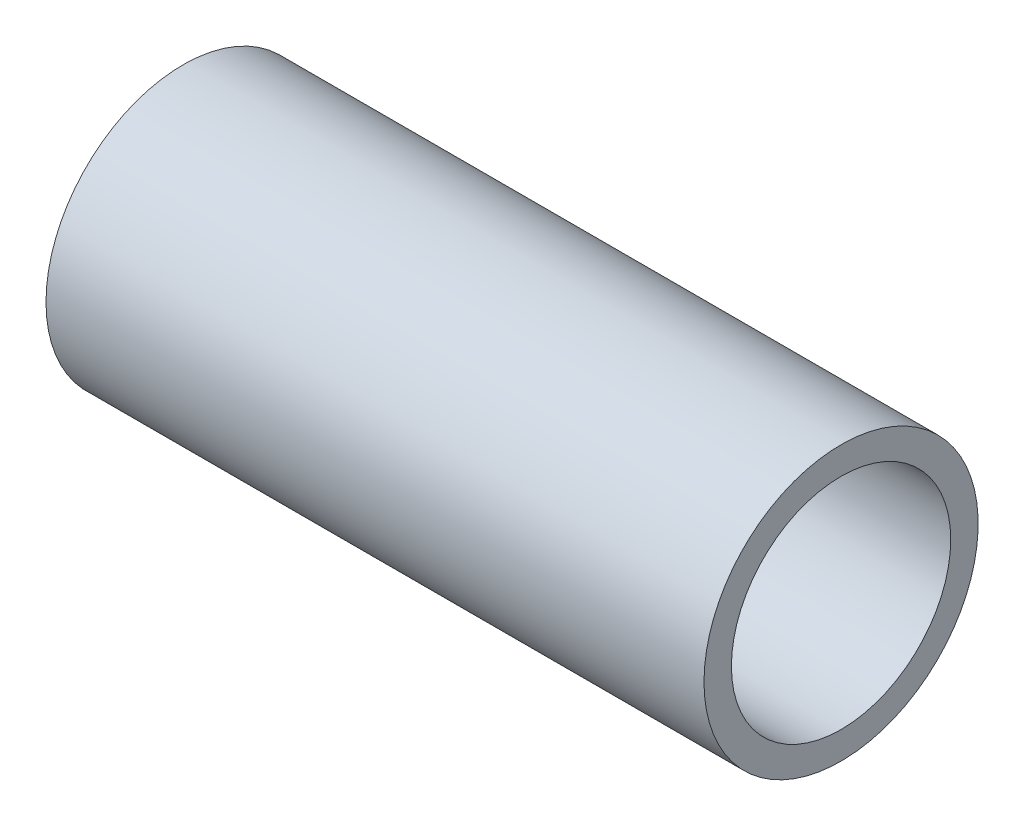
ISO-10303-21;
HEADER;
FILE_DESCRIPTION(('STEP AP214'),'2;1');
FILE_NAME('part.step','',(''),(''),'','','');
FILE_SCHEMA(('AUTOMOTIVE_DESIGN { 1 0 10303 214 1 1 1 1 }'));
ENDSEC;
DATA;
#1=APPLICATION_CONTEXT('core data for automotive mechanical design processes');
#2=APPLICATION_PROTOCOL_DEFINITION('international standard','automotive_design',2000,#1);
#3=PRODUCT_CONTEXT('',#1,'mechanical');
#4=PRODUCT('Part','Part','',(#3));
#5=PRODUCT_RELATED_PRODUCT_CATEGORY('part','',(#4));
#6=PRODUCT_DEFINITION_FORMATION('','',#4);
#7=PRODUCT_DEFINITION_CONTEXT('part definition',#1,'design');
#8=PRODUCT_DEFINITION('design','',#6,#7);
#9=PRODUCT_DEFINITION_SHAPE('','',#8);
#10=(LENGTH_UNIT() NAMED_UNIT(*) SI_UNIT(.MILLI.,.METRE.));
#11=(NAMED_UNIT(*) PLANE_ANGLE_UNIT() SI_UNIT($,.RADIAN.));
#12=(NAMED_UNIT(*) SI_UNIT($,.STERADIAN.) SOLID_ANGLE_UNIT());
#13=UNCERTAINTY_MEASURE_WITH_UNIT(LENGTH_MEASURE(1.E-05),#10,'distance_accuracy_value','');
#14=(GEOMETRIC_REPRESENTATION_CONTEXT(3) GLOBAL_UNCERTAINTY_ASSIGNED_CONTEXT((#13)) GLOBAL_UNIT_ASSIGNED_CONTEXT((#10,
#11,#12)) REPRESENTATION_CONTEXT('',''));
#15=CARTESIAN_POINT('',(0.,0.,0.));
#16=DIRECTION('',(0.,0.,1.));
#17=DIRECTION('',(1.,0.,0.));
#18=AXIS2_PLACEMENT_3D('',#15,#16,#17);
#19=CARTESIAN_POINT('',(76.2,0.,0.));
#20=DIRECTION('',(1.,0.,0.));
#21=DIRECTION('',(0.,0.,-1.));
#22=AXIS2_PLACEMENT_3D('',#19,#20,#21);
#23=PLANE('',#22);
#24=CARTESIAN_POINT('',(76.2,0.,0.));
#25=DIRECTION('',(1.,0.,0.));
#26=DIRECTION('',(0.,0.,-1.));
#27=AXIS2_PLACEMENT_3D('',#24,#25,#26);
#28=CIRCLE('',#27,15.875);
#29=CARTESIAN_POINT('',(76.2,0.,15.875));
#30=VERTEX_POINT('',#29);
#31=EDGE_CURVE('E10',#30,#30,#28,.T.);
#32=ORIENTED_EDGE('',*,*,#31,.T.);
#33=EDGE_LOOP('',(#32));
#34=FACE_BOUND('',#33,.T.);
#35=CARTESIAN_POINT('',(76.2,0.,0.));
#36=DIRECTION('',(1.,0.,0.));
#37=DIRECTION('',(0.,0.,-1.));
#38=AXIS2_PLACEMENT_3D('',#35,#36,#37);
#39=CIRCLE('',#38,12.7);
#40=CARTESIAN_POINT('',(76.2,0.,12.7));
#41=VERTEX_POINT('',#40);
#42=EDGE_CURVE('E37',#41,#41,#39,.T.);
#43=ORIENTED_EDGE('',*,*,#42,.F.);
#44=EDGE_LOOP('',(#43));
#45=FACE_BOUND('',#44,.T.);
#46=ADVANCED_FACE('F26',(#34,#45),#23,.T.);
#47=CARTESIAN_POINT('',(0.,0.,0.));
#48=DIRECTION('',(1.,0.,0.));
#49=DIRECTION('',(0.,0.,-1.));
#50=AXIS2_PLACEMENT_3D('',#47,#48,#49);
#51=PLANE('',#50);
#52=CARTESIAN_POINT('',(0.,0.,0.));
#53=DIRECTION('',(1.,0.,0.));
#54=DIRECTION('',(0.,0.,-1.));
#55=AXIS2_PLACEMENT_3D('',#52,#53,#54);
#56=CIRCLE('',#55,15.875);
#57=CARTESIAN_POINT('',(0.,0.,15.875));
#58=VERTEX_POINT('',#57);
#59=EDGE_CURVE('E33',#58,#58,#56,.T.);
#60=ORIENTED_EDGE('',*,*,#59,.F.);
#61=EDGE_LOOP('',(#60));
#62=FACE_BOUND('',#61,.T.);
#63=CARTESIAN_POINT('',(0.,0.,0.));
#64=DIRECTION('',(1.,0.,0.));
#65=DIRECTION('',(0.,0.,-1.));
#66=AXIS2_PLACEMENT_3D('',#63,#64,#65);
#67=CIRCLE('',#66,12.7);
#68=CARTESIAN_POINT('',(0.,0.,12.7));
#69=VERTEX_POINT('',#68);
#70=EDGE_CURVE('E41',#69,#69,#67,.T.);
#71=ORIENTED_EDGE('',*,*,#70,.T.);
#72=EDGE_LOOP('',(#71));
#73=FACE_BOUND('',#72,.T.);
#74=ADVANCED_FACE('F47',(#62,#73),#51,.F.);
#75=CARTESIAN_POINT('',(76.2,0.,0.));
#76=DIRECTION('',(-1.,0.,0.));
#77=DIRECTION('',(0.,0.,1.));
#78=AXIS2_PLACEMENT_3D('',#75,#76,#77);
#79=CYLINDRICAL_SURFACE('',#78,15.875);
#80=CARTESIAN_POINT('',(76.2,0.,15.875));
#81=CARTESIAN_POINT('',(75.40625,0.,15.875));
#82=CARTESIAN_POINT('',(74.6125,0.,15.875));
#83=CARTESIAN_POINT('',(73.025,0.,15.875));
#84=CARTESIAN_POINT('',(72.23125,0.,15.875));
#85=CARTESIAN_POINT('',(70.64375,0.,15.875));
#86=CARTESIAN_POINT('',(69.85,0.,15.875));
#87=CARTESIAN_POINT('',(68.2625,0.,15.875));
#88=CARTESIAN_POINT('',(67.46875,0.,15.875));
#89=CARTESIAN_POINT('',(65.88125,0.,15.875));
#90=CARTESIAN_POINT('',(65.0875,0.,15.875));
#91=CARTESIAN_POINT('',(63.5,0.,15.875));
#92=CARTESIAN_POINT('',(62.70625,0.,15.875));
#93=CARTESIAN_POINT('',(61.11875,0.,15.875));
#94=CARTESIAN_POINT('',(60.325,0.,15.875));
#95=CARTESIAN_POINT('',(58.7375,0.,15.875));
#96=CARTESIAN_POINT('',(57.94375,0.,15.875));
#97=CARTESIAN_POINT('',(56.35625,0.,15.875));
#98=CARTESIAN_POINT('',(55.5625,0.,15.875));
#99=CARTESIAN_POINT('',(53.975,0.,15.875));
#100=CARTESIAN_POINT('',(53.18125,0.,15.875));
#101=CARTESIAN_POINT('',(51.59375,0.,15.875));
#102=CARTESIAN_POINT('',(50.8,0.,15.875));
#103=CARTESIAN_POINT('',(49.2125,0.,15.875));
#104=CARTESIAN_POINT('',(48.41875,0.,15.875));
#105=CARTESIAN_POINT('',(46.83125,0.,15.875));
#106=CARTESIAN_POINT('',(46.0375,0.,15.875));
#107=CARTESIAN_POINT('',(44.45,0.,15.875));
#108=CARTESIAN_POINT('',(43.65625,0.,15.875));
#109=CARTESIAN_POINT('',(42.06875,0.,15.875));
#110=CARTESIAN_POINT('',(41.275,0.,15.875));
#111=CARTESIAN_POINT('',(39.6875,0.,15.875));
#112=CARTESIAN_POINT('',(38.89375,0.,15.875));
#113=CARTESIAN_POINT('',(37.30625,0.,15.875));
#114=CARTESIAN_POINT('',(36.5125,0.,15.875));
#115=CARTESIAN_POINT('',(34.925,0.,15.875));
#116=CARTESIAN_POINT('',(34.13125,0.,15.875));
#117=CARTESIAN_POINT('',(32.54375,0.,15.875));
#118=CARTESIAN_POINT('',(31.75,0.,15.875));
#119=CARTESIAN_POINT('',(30.1625,0.,15.875));
#120=CARTESIAN_POINT('',(29.36875,0.,15.875));
#121=CARTESIAN_POINT('',(27.78125,0.,15.875));
#122=CARTESIAN_POINT('',(26.9875,0.,15.875));
#123=CARTESIAN_POINT('',(25.4,0.,15.875));
#124=CARTESIAN_POINT('',(24.60625,0.,15.875));
#125=CARTESIAN_POINT('',(23.01875,0.,15.875));
#126=CARTESIAN_POINT('',(22.225,0.,15.875));
#127=CARTESIAN_POINT('',(20.6375,0.,15.875));
#128=CARTESIAN_POINT('',(19.84375,0.,15.875));
#129=CARTESIAN_POINT('',(18.25625,0.,15.875));
#130=CARTESIAN_POINT('',(17.4625,0.,15.875));
#131=CARTESIAN_POINT('',(15.875,0.,15.875));
#132=CARTESIAN_POINT('',(15.08125,0.,15.875));
#133=CARTESIAN_POINT('',(13.49375,0.,15.875));
#134=CARTESIAN_POINT('',(12.7,0.,15.875));
#135=CARTESIAN_POINT('',(11.1125,0.,15.875));
#136=CARTESIAN_POINT('',(10.31875,0.,15.875));
#137=CARTESIAN_POINT('',(8.73125,0.,15.875));
#138=CARTESIAN_POINT('',(7.93750000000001,0.,15.875));
#139=CARTESIAN_POINT('',(6.35,0.,15.875));
#140=CARTESIAN_POINT('',(5.55625,0.,15.875));
#141=CARTESIAN_POINT('',(3.96875,0.,15.875));
#142=CARTESIAN_POINT('',(3.175,0.,15.875));
#143=CARTESIAN_POINT('',(1.5875,0.,15.875));
#144=CARTESIAN_POINT('',(0.793750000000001,0.,15.875));
#145=CARTESIAN_POINT('',(0.,0.,15.875));
#146=B_SPLINE_CURVE_WITH_KNOTS('',3,(#80,#81,#82,#83,#84,#85,#86,#87,#88,#89,#90,#91,#92,#93,
#94,#95,#96,#97,#98,#99,#100,#101,#102,#103,#104,#105,#106,#107,#108,#109,#110,#111,#112,#113,
#114,#115,#116,#117,#118,#119,#120,#121,#122,#123,#124,#125,#126,#127,#128,#129,#130,#131,#132,
#133,#134,#135,#136,#137,#138,#139,#140,#141,#142,#143,#144,#145),.UNSPECIFIED.,.F.,.F.,(4,2,2,
2,2,2,2,2,2,2,2,2,2,2,2,2,2,2,2,2,2,2,2,2,2,2,2,2,2,2,2,2,4),(0.,2.38125,4.7625,7.14375,
9.52500000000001,11.90625,14.2875,16.66875,19.05,21.43125,23.8125,26.19375,28.575,30.95625,
33.3375,35.71875,38.1,40.48125,42.8625,45.24375,47.625,50.00625,52.3875,54.76875,57.15,59.53125,
61.9125,64.29375,66.675,69.05625,71.4375,73.81875,76.2),.UNSPECIFIED.);
#147=EDGE_CURVE('BSEAM28',#30,#58,#146,.T.);
#148=ORIENTED_EDGE('',*,*,#31,.F.);
#149=ORIENTED_EDGE('',*,*,#59,.T.);
#150=ORIENTED_EDGE('',*,*,#147,.T.);
#151=ORIENTED_EDGE('',*,*,#147,.F.);
#152=EDGE_LOOP('',(#148,#150,#149,#151));
#153=FACE_BOUND('',#152,.T.);
#154=ADVANCED_FACE('F28',(#153),#79,.T.);
#155=CARTESIAN_POINT('',(76.2,0.,0.));
#156=DIRECTION('',(-1.,0.,0.));
#157=DIRECTION('',(0.,0.,1.));
#158=AXIS2_PLACEMENT_3D('',#155,#156,#157);
#159=CYLINDRICAL_SURFACE('',#158,12.7);
#160=CARTESIAN_POINT('',(76.2,0.,12.7));
#161=CARTESIAN_POINT('',(75.40625,0.,12.7));
#162=CARTESIAN_POINT('',(74.6125,0.,12.7));
#163=CARTESIAN_POINT('',(73.025,0.,12.7));
#164=CARTESIAN_POINT('',(72.23125,0.,12.7));
#165=CARTESIAN_POINT('',(70.64375,0.,12.7));
#166=CARTESIAN_POINT('',(69.85,0.,12.7));
#167=CARTESIAN_POINT('',(68.2625,0.,12.7));
#168=CARTESIAN_POINT('',(67.46875,0.,12.7));
#169=CARTESIAN_POINT('',(65.88125,0.,12.7));
#170=CARTESIAN_POINT('',(65.0875,0.,12.7));
#171=CARTESIAN_POINT('',(63.5,0.,12.7));
#172=CARTESIAN_POINT('',(62.70625,0.,12.7));
#173=CARTESIAN_POINT('',(61.11875,0.,12.7));
#174=CARTESIAN_POINT('',(60.325,0.,12.7));
#175=CARTESIAN_POINT('',(58.7375,0.,12.7));
#176=CARTESIAN_POINT('',(57.94375,0.,12.7));
#177=CARTESIAN_POINT('',(56.35625,0.,12.7));
#178=CARTESIAN_POINT('',(55.5625,0.,12.7));
#179=CARTESIAN_POINT('',(53.975,0.,12.7));
#180=CARTESIAN_POINT('',(53.18125,0.,12.7));
#181=CARTESIAN_POINT('',(51.59375,0.,12.7));
#182=CARTESIAN_POINT('',(50.8,0.,12.7));
#183=CARTESIAN_POINT('',(49.2125,0.,12.7));
#184=CARTESIAN_POINT('',(48.41875,0.,12.7));
#185=CARTESIAN_POINT('',(46.83125,0.,12.7));
#186=CARTESIAN_POINT('',(46.0375,0.,12.7));
#187=CARTESIAN_POINT('',(44.45,0.,12.7));
#188=CARTESIAN_POINT('',(43.65625,0.,12.7));
#189=CARTESIAN_POINT('',(42.06875,0.,12.7));
#190=CARTESIAN_POINT('',(41.275,0.,12.7));
#191=CARTESIAN_POINT('',(39.6875,0.,12.7));
#192=CARTESIAN_POINT('',(38.89375,0.,12.7));
#193=CARTESIAN_POINT('',(37.30625,0.,12.7));
#194=CARTESIAN_POINT('',(36.5125,0.,12.7));
#195=CARTESIAN_POINT('',(34.925,0.,12.7));
#196=CARTESIAN_POINT('',(34.13125,0.,12.7));
#197=CARTESIAN_POINT('',(32.54375,0.,12.7));
#198=CARTESIAN_POINT('',(31.75,0.,12.7));
#199=CARTESIAN_POINT('',(30.1625,0.,12.7));
#200=CARTESIAN_POINT('',(29.36875,0.,12.7));
#201=CARTESIAN_POINT('',(27.78125,0.,12.7));
#202=CARTESIAN_POINT('',(26.9875,0.,12.7));
#203=CARTESIAN_POINT('',(25.4,0.,12.7));
#204=CARTESIAN_POINT('',(24.60625,0.,12.7));
#205=CARTESIAN_POINT('',(23.01875,0.,12.7));
#206=CARTESIAN_POINT('',(22.225,0.,12.7));
#207=CARTESIAN_POINT('',(20.6375,0.,12.7));
#208=CARTESIAN_POINT('',(19.84375,0.,12.7));
#209=CARTESIAN_POINT('',(18.25625,0.,12.7));
#210=CARTESIAN_POINT('',(17.4625,0.,12.7));
#211=CARTESIAN_POINT('',(15.875,0.,12.7));
#212=CARTESIAN_POINT('',(15.08125,0.,12.7));
#213=CARTESIAN_POINT('',(13.49375,0.,12.7));
#214=CARTESIAN_POINT('',(12.7,0.,12.7));
#215=CARTESIAN_POINT('',(11.1125,0.,12.7));
#216=CARTESIAN_POINT('',(10.31875,0.,12.7));
#217=CARTESIAN_POINT('',(8.73125,0.,12.7));
#218=CARTESIAN_POINT('',(7.93750000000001,0.,12.7));
#219=CARTESIAN_POINT('',(6.35,0.,12.7));
#220=CARTESIAN_POINT('',(5.55625,0.,12.7));
#221=CARTESIAN_POINT('',(3.96875,0.,12.7));
#222=CARTESIAN_POINT('',(3.175,0.,12.7));
#223=CARTESIAN_POINT('',(1.5875,0.,12.7));
#224=CARTESIAN_POINT('',(0.793750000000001,0.,12.7));
#225=CARTESIAN_POINT('',(0.,0.,12.7));
#226=B_SPLINE_CURVE_WITH_KNOTS('',3,(#160,#161,#162,#163,#164,#165,#166,#167,#168,#169,#170,
#171,#172,#173,#174,#175,#176,#177,#178,#179,#180,#181,#182,#183,#184,#185,#186,#187,#188,#189,
#190,#191,#192,#193,#194,#195,#196,#197,#198,#199,#200,#201,#202,#203,#204,#205,#206,#207,#208,
#209,#210,#211,#212,#213,#214,#215,#216,#217,#218,#219,#220,#221,#222,#223,#224,#225),
.UNSPECIFIED.,.F.,.F.,(4,2,2,2,2,2,2,2,2,2,2,2,2,2,2,2,2,2,2,2,2,2,2,2,2,2,2,2,2,2,2,2,4),(0.,
2.38124999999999,4.76249999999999,7.14374999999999,9.52499999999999,11.90625,14.2875,16.66875,
19.05,21.43125,23.8125,26.19375,28.575,30.95625,33.3375,35.71875,38.1,40.48125,42.8625,45.24375,
47.625,50.00625,52.3875,54.76875,57.15,59.53125,61.9125,64.29375,66.675,69.05625,71.4375,
73.81875,76.2),.UNSPECIFIED.);
#227=EDGE_CURVE('BSEAM49',#41,#69,#226,.T.);
#228=ORIENTED_EDGE('',*,*,#42,.T.);
#229=ORIENTED_EDGE('',*,*,#70,.F.);
#230=ORIENTED_EDGE('',*,*,#227,.T.);
#231=ORIENTED_EDGE('',*,*,#227,.F.);
#232=EDGE_LOOP('',(#228,#230,#229,#231));
#233=FACE_BOUND('',#232,.T.);
#234=ADVANCED_FACE('F49',(#233),#159,.F.);
#235=CLOSED_SHELL('',(#46,#74,#154,#234));
#236=MANIFOLD_SOLID_BREP('B2',#235);
#237=ADVANCED_BREP_SHAPE_REPRESENTATION('',(#18,#236),#14);
#238=SHAPE_DEFINITION_REPRESENTATION(#9,#237);
ENDSEC;
END-ISO-10303-21;
